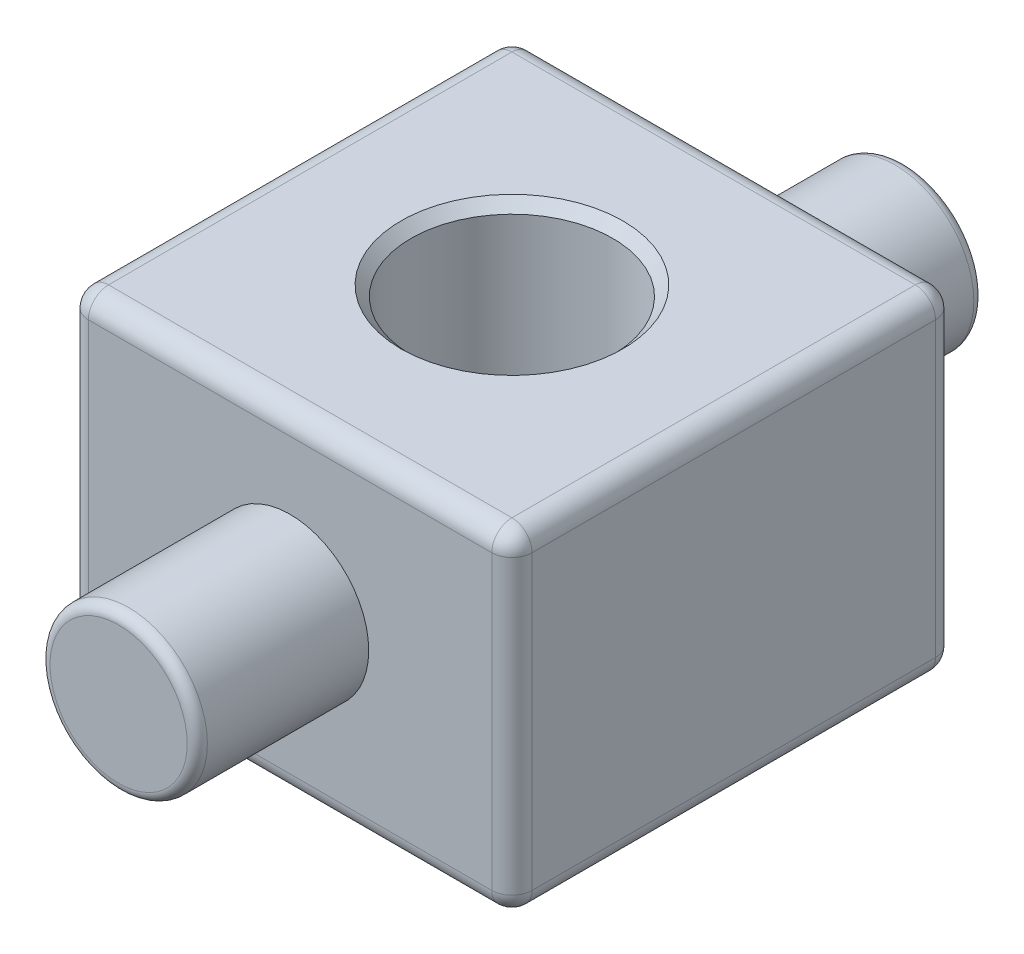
ISO-10303-21;
HEADER;
FILE_DESCRIPTION(('STEP AP214'),'2;1');
FILE_NAME('part.step','',(''),(''),'','','');
FILE_SCHEMA(('AUTOMOTIVE_DESIGN { 1 0 10303 214 1 1 1 1 }'));
ENDSEC;
DATA;
#1=APPLICATION_CONTEXT('core data for automotive mechanical design processes');
#2=APPLICATION_PROTOCOL_DEFINITION('international standard','automotive_design',2000,#1);
#3=PRODUCT_CONTEXT('',#1,'mechanical');
#4=PRODUCT('Part','Part','',(#3));
#5=PRODUCT_RELATED_PRODUCT_CATEGORY('part','',(#4));
#6=PRODUCT_DEFINITION_FORMATION('','',#4);
#7=PRODUCT_DEFINITION_CONTEXT('part definition',#1,'design');
#8=PRODUCT_DEFINITION('design','',#6,#7);
#9=PRODUCT_DEFINITION_SHAPE('','',#8);
#10=(LENGTH_UNIT() NAMED_UNIT(*) SI_UNIT(.MILLI.,.METRE.));
#11=(NAMED_UNIT(*) PLANE_ANGLE_UNIT() SI_UNIT($,.RADIAN.));
#12=(NAMED_UNIT(*) SI_UNIT($,.STERADIAN.) SOLID_ANGLE_UNIT());
#13=UNCERTAINTY_MEASURE_WITH_UNIT(LENGTH_MEASURE(1.E-05),#10,'distance_accuracy_value','');
#14=(GEOMETRIC_REPRESENTATION_CONTEXT(3) GLOBAL_UNCERTAINTY_ASSIGNED_CONTEXT((#13)) GLOBAL_UNIT_ASSIGNED_CONTEXT((#10,
#11,#12)) REPRESENTATION_CONTEXT('',''));
#15=CARTESIAN_POINT('',(0.,0.,0.));
#16=DIRECTION('',(0.,0.,1.));
#17=DIRECTION('',(1.,0.,0.));
#18=AXIS2_PLACEMENT_3D('',#15,#16,#17);
#19=CARTESIAN_POINT('',(11.,8.25,-11.));
#20=DIRECTION('',(1.,0.,0.));
#21=DIRECTION('',(0.,1.,0.));
#22=AXIS2_PLACEMENT_3D('',#19,#20,#21);
#23=PLANE('',#22);
#24=DIRECTION('',(0.,1.,0.));
#25=VECTOR('',#24,1.);
#26=CARTESIAN_POINT('',(11.,8.25,10.));
#27=LINE('',#26,#25);
#28=CARTESIAN_POINT('',(11.,7.25,10.));
#29=VERTEX_POINT('',#28);
#30=CARTESIAN_POINT('',(11.,-7.25,10.));
#31=VERTEX_POINT('',#30);
#32=EDGE_CURVE('E381',#29,#31,#27,.F.);
#33=ORIENTED_EDGE('',*,*,#32,.T.);
#34=DIRECTION('',(0.,0.,1.));
#35=VECTOR('',#34,1.);
#36=CARTESIAN_POINT('',(11.,-7.25,-11.));
#37=LINE('',#36,#35);
#38=CARTESIAN_POINT('',(11.,-7.25,-10.));
#39=VERTEX_POINT('',#38);
#40=EDGE_CURVE('E380',#31,#39,#37,.F.);
#41=ORIENTED_EDGE('',*,*,#40,.T.);
#42=DIRECTION('',(0.,1.,0.));
#43=VECTOR('',#42,1.);
#44=CARTESIAN_POINT('',(11.,8.25,-10.));
#45=LINE('',#44,#43);
#46=CARTESIAN_POINT('',(11.,7.25,-10.));
#47=VERTEX_POINT('',#46);
#48=EDGE_CURVE('E376',#39,#47,#45,.T.);
#49=ORIENTED_EDGE('',*,*,#48,.T.);
#50=DIRECTION('',(0.,0.,1.));
#51=VECTOR('',#50,1.);
#52=CARTESIAN_POINT('',(11.,7.25,-11.));
#53=LINE('',#52,#51);
#54=EDGE_CURVE('E408',#47,#29,#53,.T.);
#55=ORIENTED_EDGE('',*,*,#54,.T.);
#56=EDGE_LOOP('',(#33,#41,#49,#55));
#57=FACE_BOUND('',#56,.T.);
#58=ADVANCED_FACE('F33',(#57),#23,.T.);
#59=CARTESIAN_POINT('',(-11.,-8.25,-11.));
#60=DIRECTION('',(0.,-1.,0.));
#61=DIRECTION('',(0.,0.,-1.));
#62=AXIS2_PLACEMENT_3D('',#59,#60,#61);
#63=PLANE('',#62);
#64=CARTESIAN_POINT('',(0.,-8.25,0.));
#65=DIRECTION('',(0.,-1.,0.));
#66=DIRECTION('',(0.,0.,-1.));
#67=AXIS2_PLACEMENT_3D('',#64,#65,#66);
#68=CIRCLE('',#67,4.);
#69=CARTESIAN_POINT('',(0.,-8.25,-4.));
#70=VERTEX_POINT('',#69);
#71=EDGE_CURVE('E204',#70,#70,#68,.F.);
#72=ORIENTED_EDGE('',*,*,#71,.T.);
#73=EDGE_LOOP('',(#72));
#74=FACE_BOUND('',#73,.T.);
#75=DIRECTION('',(1.,0.,0.));
#76=VECTOR('',#75,1.);
#77=CARTESIAN_POINT('',(11.,-8.25,-10.));
#78=LINE('',#77,#76);
#79=CARTESIAN_POINT('',(-9.99999999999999,-8.25,-10.));
#80=VERTEX_POINT('',#79);
#81=CARTESIAN_POINT('',(10.,-8.25,-10.));
#82=VERTEX_POINT('',#81);
#83=EDGE_CURVE('E131',#80,#82,#78,.T.);
#84=ORIENTED_EDGE('',*,*,#83,.T.);
#85=DIRECTION('',(0.,0.,1.));
#86=VECTOR('',#85,1.);
#87=CARTESIAN_POINT('',(10.,-8.25,-11.));
#88=LINE('',#87,#86);
#89=CARTESIAN_POINT('',(10.,-8.25,10.));
#90=VERTEX_POINT('',#89);
#91=EDGE_CURVE('E127',#82,#90,#88,.T.);
#92=ORIENTED_EDGE('',*,*,#91,.T.);
#93=DIRECTION('',(1.,0.,0.));
#94=VECTOR('',#93,1.);
#95=CARTESIAN_POINT('',(-11.,-8.25,10.));
#96=LINE('',#95,#94);
#97=CARTESIAN_POINT('',(-9.99999999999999,-8.25,10.));
#98=VERTEX_POINT('',#97);
#99=EDGE_CURVE('E121',#90,#98,#96,.F.);
#100=ORIENTED_EDGE('',*,*,#99,.T.);
#101=DIRECTION('',(0.,0.,1.));
#102=VECTOR('',#101,1.);
#103=CARTESIAN_POINT('',(-9.99999999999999,-8.25,-11.));
#104=LINE('',#103,#102);
#105=EDGE_CURVE('E124',#98,#80,#104,.F.);
#106=ORIENTED_EDGE('',*,*,#105,.T.);
#107=EDGE_LOOP('',(#84,#92,#100,#106));
#108=FACE_BOUND('',#107,.T.);
#109=ADVANCED_FACE('F123',(#74,#108),#63,.T.);
#110=CARTESIAN_POINT('',(-11.,8.25,-11.));
#111=DIRECTION('',(-1.,0.,0.));
#112=DIRECTION('',(0.,-1.,0.));
#113=AXIS2_PLACEMENT_3D('',#110,#111,#112);
#114=PLANE('',#113);
#115=DIRECTION('',(0.,0.,1.));
#116=VECTOR('',#115,1.);
#117=CARTESIAN_POINT('',(-11.,7.25,-11.));
#118=LINE('',#117,#116);
#119=CARTESIAN_POINT('',(-11.,7.25,10.));
#120=VERTEX_POINT('',#119);
#121=CARTESIAN_POINT('',(-11.,7.25,-10.));
#122=VERTEX_POINT('',#121);
#123=EDGE_CURVE('E330',#120,#122,#118,.F.);
#124=ORIENTED_EDGE('',*,*,#123,.T.);
#125=DIRECTION('',(0.,-1.,0.));
#126=VECTOR('',#125,1.);
#127=CARTESIAN_POINT('',(-11.,-8.25,-10.));
#128=LINE('',#127,#126);
#129=CARTESIAN_POINT('',(-11.,-7.25,-10.));
#130=VERTEX_POINT('',#129);
#131=EDGE_CURVE('E338',#122,#130,#128,.T.);
#132=ORIENTED_EDGE('',*,*,#131,.T.);
#133=DIRECTION('',(0.,0.,1.));
#134=VECTOR('',#133,1.);
#135=CARTESIAN_POINT('',(-11.,-7.25,-11.));
#136=LINE('',#135,#134);
#137=CARTESIAN_POINT('',(-11.,-7.25,10.));
#138=VERTEX_POINT('',#137);
#139=EDGE_CURVE('E341',#130,#138,#136,.T.);
#140=ORIENTED_EDGE('',*,*,#139,.T.);
#141=DIRECTION('',(0.,-1.,0.));
#142=VECTOR('',#141,1.);
#143=CARTESIAN_POINT('',(-11.,8.25,10.));
#144=LINE('',#143,#142);
#145=EDGE_CURVE('E345',#138,#120,#144,.F.);
#146=ORIENTED_EDGE('',*,*,#145,.T.);
#147=EDGE_LOOP('',(#124,#132,#140,#146));
#148=FACE_BOUND('',#147,.T.);
#149=ADVANCED_FACE('F228',(#148),#114,.T.);
#150=CARTESIAN_POINT('',(-11.,8.25,-11.));
#151=DIRECTION('',(0.,1.,0.));
#152=DIRECTION('',(0.,0.,1.));
#153=AXIS2_PLACEMENT_3D('',#150,#151,#152);
#154=PLANE('',#153);
#155=CARTESIAN_POINT('',(0.,8.25,0.));
#156=DIRECTION('',(0.,1.,0.));
#157=DIRECTION('',(0.,0.,1.));
#158=AXIS2_PLACEMENT_3D('',#155,#156,#157);
#159=CIRCLE('',#158,5.5);
#160=CARTESIAN_POINT('',(0.,8.25,5.5));
#161=VERTEX_POINT('',#160);
#162=EDGE_CURVE('E11',#161,#161,#159,.F.);
#163=ORIENTED_EDGE('',*,*,#162,.T.);
#164=EDGE_LOOP('',(#163));
#165=FACE_BOUND('',#164,.T.);
#166=DIRECTION('',(0.,0.,1.));
#167=VECTOR('',#166,1.);
#168=CARTESIAN_POINT('',(10.,8.25,-11.));
#169=LINE('',#168,#167);
#170=CARTESIAN_POINT('',(10.,8.25,10.));
#171=VERTEX_POINT('',#170);
#172=CARTESIAN_POINT('',(10.,8.25,-10.));
#173=VERTEX_POINT('',#172);
#174=EDGE_CURVE('E48',#171,#173,#169,.F.);
#175=ORIENTED_EDGE('',*,*,#174,.T.);
#176=DIRECTION('',(-1.,0.,0.));
#177=VECTOR('',#176,1.);
#178=CARTESIAN_POINT('',(-11.,8.25,-10.));
#179=LINE('',#178,#177);
#180=CARTESIAN_POINT('',(-10.,8.25,-10.));
#181=VERTEX_POINT('',#180);
#182=EDGE_CURVE('E205',#173,#181,#179,.T.);
#183=ORIENTED_EDGE('',*,*,#182,.T.);
#184=DIRECTION('',(0.,0.,1.));
#185=VECTOR('',#184,1.);
#186=CARTESIAN_POINT('',(-10.,8.25,-11.));
#187=LINE('',#186,#185);
#188=CARTESIAN_POINT('',(-10.,8.25,10.));
#189=VERTEX_POINT('',#188);
#190=EDGE_CURVE('E331',#181,#189,#187,.T.);
#191=ORIENTED_EDGE('',*,*,#190,.T.);
#192=DIRECTION('',(-1.,0.,0.));
#193=VECTOR('',#192,1.);
#194=CARTESIAN_POINT('',(-11.,8.25,10.));
#195=LINE('',#194,#193);
#196=EDGE_CURVE('E53',#189,#171,#195,.F.);
#197=ORIENTED_EDGE('',*,*,#196,.T.);
#198=EDGE_LOOP('',(#175,#183,#191,#197));
#199=FACE_BOUND('',#198,.T.);
#200=ADVANCED_FACE('F233',(#165,#199),#154,.T.);
#201=CARTESIAN_POINT('',(0.,0.,-11.));
#202=DIRECTION('',(0.,0.,1.));
#203=DIRECTION('',(1.,0.,0.));
#204=AXIS2_PLACEMENT_3D('',#201,#202,#203);
#205=PLANE('',#204);
#206=DIRECTION('',(-1.,0.,0.));
#207=VECTOR('',#206,1.);
#208=CARTESIAN_POINT('',(11.,7.25,-11.));
#209=LINE('',#208,#207);
#210=CARTESIAN_POINT('',(-10.,7.25,-11.));
#211=VERTEX_POINT('',#210);
#212=CARTESIAN_POINT('',(10.,7.25,-11.));
#213=VERTEX_POINT('',#212);
#214=EDGE_CURVE('E387',#211,#213,#209,.F.);
#215=ORIENTED_EDGE('',*,*,#214,.T.);
#216=DIRECTION('',(0.,1.,0.));
#217=VECTOR('',#216,1.);
#218=CARTESIAN_POINT('',(10.,-8.25,-11.));
#219=LINE('',#218,#217);
#220=CARTESIAN_POINT('',(10.,-7.25,-11.));
#221=VERTEX_POINT('',#220);
#222=EDGE_CURVE('E396',#213,#221,#219,.F.);
#223=ORIENTED_EDGE('',*,*,#222,.T.);
#224=DIRECTION('',(1.,0.,0.));
#225=VECTOR('',#224,1.);
#226=CARTESIAN_POINT('',(-11.,-7.25,-11.));
#227=LINE('',#226,#225);
#228=CARTESIAN_POINT('',(-9.99999999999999,-7.25,-11.));
#229=VERTEX_POINT('',#228);
#230=EDGE_CURVE('E394',#221,#229,#227,.F.);
#231=ORIENTED_EDGE('',*,*,#230,.T.);
#232=DIRECTION('',(0.,-1.,0.));
#233=VECTOR('',#232,1.);
#234=CARTESIAN_POINT('',(-10.,8.25,-11.));
#235=LINE('',#234,#233);
#236=EDGE_CURVE('E389',#229,#211,#235,.F.);
#237=ORIENTED_EDGE('',*,*,#236,.T.);
#238=EDGE_LOOP('',(#215,#223,#231,#237));
#239=FACE_BOUND('',#238,.T.);
#240=CARTESIAN_POINT('',(0.,0.,-11.));
#241=DIRECTION('',(0.,0.,1.));
#242=DIRECTION('',(1.,0.,0.));
#243=AXIS2_PLACEMENT_3D('',#240,#241,#242);
#244=CIRCLE('',#243,3.9);
#245=CARTESIAN_POINT('',(3.9,0.,-11.));
#246=VERTEX_POINT('',#245);
#247=EDGE_CURVE('E451',#246,#246,#244,.T.);
#248=ORIENTED_EDGE('',*,*,#247,.T.);
#249=EDGE_LOOP('',(#248));
#250=FACE_BOUND('',#249,.T.);
#251=ADVANCED_FACE('F411',(#239,#250),#205,.F.);
#252=CARTESIAN_POINT('',(0.,0.,11.));
#253=DIRECTION('',(0.,0.,1.));
#254=DIRECTION('',(1.,0.,0.));
#255=AXIS2_PLACEMENT_3D('',#252,#253,#254);
#256=PLANE('',#255);
#257=DIRECTION('',(1.,0.,0.));
#258=VECTOR('',#257,1.);
#259=CARTESIAN_POINT('',(0.,-7.25,11.));
#260=LINE('',#259,#258);
#261=CARTESIAN_POINT('',(-9.99999999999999,-7.25,11.));
#262=VERTEX_POINT('',#261);
#263=CARTESIAN_POINT('',(10.,-7.25,11.));
#264=VERTEX_POINT('',#263);
#265=EDGE_CURVE('E153',#262,#264,#260,.T.);
#266=ORIENTED_EDGE('',*,*,#265,.T.);
#267=DIRECTION('',(0.,1.,0.));
#268=VECTOR('',#267,1.);
#269=CARTESIAN_POINT('',(10.,0.,11.));
#270=LINE('',#269,#268);
#271=CARTESIAN_POINT('',(10.,7.25,11.));
#272=VERTEX_POINT('',#271);
#273=EDGE_CURVE('E351',#264,#272,#270,.T.);
#274=ORIENTED_EDGE('',*,*,#273,.T.);
#275=DIRECTION('',(-1.,0.,0.));
#276=VECTOR('',#275,1.);
#277=CARTESIAN_POINT('',(0.,7.25,11.));
#278=LINE('',#277,#276);
#279=CARTESIAN_POINT('',(-10.,7.25,11.));
#280=VERTEX_POINT('',#279);
#281=EDGE_CURVE('E340',#272,#280,#278,.T.);
#282=ORIENTED_EDGE('',*,*,#281,.T.);
#283=DIRECTION('',(0.,-1.,0.));
#284=VECTOR('',#283,1.);
#285=CARTESIAN_POINT('',(-10.,0.,11.));
#286=LINE('',#285,#284);
#287=EDGE_CURVE('E343',#280,#262,#286,.T.);
#288=ORIENTED_EDGE('',*,*,#287,.T.);
#289=EDGE_LOOP('',(#266,#274,#282,#288));
#290=FACE_BOUND('',#289,.T.);
#291=CARTESIAN_POINT('',(0.,0.,11.));
#292=DIRECTION('',(0.,0.,1.));
#293=DIRECTION('',(1.,0.,0.));
#294=AXIS2_PLACEMENT_3D('',#291,#292,#293);
#295=CIRCLE('',#294,3.9);
#296=CARTESIAN_POINT('',(3.9,0.,11.));
#297=VERTEX_POINT('',#296);
#298=EDGE_CURVE('E454',#297,#297,#295,.T.);
#299=ORIENTED_EDGE('',*,*,#298,.F.);
#300=EDGE_LOOP('',(#299));
#301=FACE_BOUND('',#300,.T.);
#302=ADVANCED_FACE('F417',(#290,#301),#256,.T.);
#303=CARTESIAN_POINT('',(0.,0.,19.5));
#304=DIRECTION('',(0.,0.,-1.));
#305=DIRECTION('',(-1.,0.,0.));
#306=AXIS2_PLACEMENT_3D('',#303,#304,#305);
#307=CYLINDRICAL_SURFACE('',#306,3.9);
#308=CARTESIAN_POINT('',(0.,0.,19.));
#309=DIRECTION('',(0.,0.,1.));
#310=DIRECTION('',(1.,0.,0.));
#311=AXIS2_PLACEMENT_3D('',#308,#309,#310);
#312=CIRCLE('',#311,3.9);
#313=CARTESIAN_POINT('',(3.9,0.,19.));
#314=VERTEX_POINT('',#313);
#315=EDGE_CURVE('E463',#314,#314,#312,.F.);
#316=ORIENTED_EDGE('',*,*,#315,.T.);
#317=EDGE_LOOP('',(#316));
#318=FACE_BOUND('',#317,.T.);
#319=ORIENTED_EDGE('',*,*,#298,.T.);
#320=EDGE_LOOP('',(#319));
#321=FACE_BOUND('',#320,.T.);
#322=ADVANCED_FACE('F425',(#318,#321),#307,.T.);
#323=CARTESIAN_POINT('',(0.,0.,19.5));
#324=DIRECTION('',(0.,0.,1.));
#325=DIRECTION('',(1.,0.,0.));
#326=AXIS2_PLACEMENT_3D('',#323,#324,#325);
#327=PLANE('',#326);
#328=CARTESIAN_POINT('',(0.,0.,19.5));
#329=DIRECTION('',(0.,0.,1.));
#330=DIRECTION('',(1.,0.,0.));
#331=AXIS2_PLACEMENT_3D('',#328,#329,#330);
#332=CIRCLE('',#331,3.4);
#333=CARTESIAN_POINT('',(3.4,0.,19.5));
#334=VERTEX_POINT('',#333);
#335=EDGE_CURVE('E460',#334,#334,#332,.T.);
#336=ORIENTED_EDGE('',*,*,#335,.T.);
#337=EDGE_LOOP('',(#336));
#338=FACE_BOUND('',#337,.T.);
#339=ADVANCED_FACE('F239',(#338),#327,.T.);
#340=CARTESIAN_POINT('',(0.,0.,19.));
#341=DIRECTION('',(0.,0.,1.));
#342=DIRECTION('',(1.,0.,0.));
#343=AXIS2_PLACEMENT_3D('',#340,#341,#342);
#344=TOROIDAL_SURFACE('',#343,3.4,0.5);
#345=ORIENTED_EDGE('',*,*,#315,.F.);
#346=EDGE_LOOP('',(#345));
#347=FACE_BOUND('',#346,.T.);
#348=ORIENTED_EDGE('',*,*,#335,.F.);
#349=EDGE_LOOP('',(#348));
#350=FACE_BOUND('',#349,.T.);
#351=ADVANCED_FACE('F235',(#347,#350),#344,.T.);
#352=CARTESIAN_POINT('',(0.,0.,-19.5));
#353=DIRECTION('',(0.,0.,1.));
#354=DIRECTION('',(1.,0.,0.));
#355=AXIS2_PLACEMENT_3D('',#352,#353,#354);
#356=CYLINDRICAL_SURFACE('',#355,3.9);
#357=CARTESIAN_POINT('',(0.,0.,-19.));
#358=DIRECTION('',(0.,0.,-1.));
#359=DIRECTION('',(-1.,0.,0.));
#360=AXIS2_PLACEMENT_3D('',#357,#358,#359);
#361=CIRCLE('',#360,3.9);
#362=CARTESIAN_POINT('',(-3.9,0.,-19.));
#363=VERTEX_POINT('',#362);
#364=EDGE_CURVE('E466',#363,#363,#361,.F.);
#365=ORIENTED_EDGE('',*,*,#364,.T.);
#366=EDGE_LOOP('',(#365));
#367=FACE_BOUND('',#366,.T.);
#368=ORIENTED_EDGE('',*,*,#247,.F.);
#369=EDGE_LOOP('',(#368));
#370=FACE_BOUND('',#369,.T.);
#371=ADVANCED_FACE('F238',(#367,#370),#356,.T.);
#372=CARTESIAN_POINT('',(0.,0.,-19.5));
#373=DIRECTION('',(0.,0.,-1.));
#374=DIRECTION('',(1.,0.,0.));
#375=AXIS2_PLACEMENT_3D('',#372,#373,#374);
#376=PLANE('',#375);
#377=CARTESIAN_POINT('',(0.,0.,-19.5));
#378=DIRECTION('',(0.,0.,-1.));
#379=DIRECTION('',(-1.,0.,0.));
#380=AXIS2_PLACEMENT_3D('',#377,#378,#379);
#381=CIRCLE('',#380,3.4);
#382=CARTESIAN_POINT('',(-3.4,0.,-19.5));
#383=VERTEX_POINT('',#382);
#384=EDGE_CURVE('E142',#383,#383,#381,.T.);
#385=ORIENTED_EDGE('',*,*,#384,.T.);
#386=EDGE_LOOP('',(#385));
#387=FACE_BOUND('',#386,.T.);
#388=ADVANCED_FACE('F244',(#387),#376,.T.);
#389=CARTESIAN_POINT('',(0.,0.,-19.));
#390=DIRECTION('',(0.,0.,-1.));
#391=DIRECTION('',(-1.,0.,0.));
#392=AXIS2_PLACEMENT_3D('',#389,#390,#391);
#393=TOROIDAL_SURFACE('',#392,3.4,0.5);
#394=ORIENTED_EDGE('',*,*,#384,.F.);
#395=EDGE_LOOP('',(#394));
#396=FACE_BOUND('',#395,.T.);
#397=ORIENTED_EDGE('',*,*,#364,.F.);
#398=EDGE_LOOP('',(#397));
#399=FACE_BOUND('',#398,.T.);
#400=ADVANCED_FACE('F241',(#396,#399),#393,.T.);
#401=CARTESIAN_POINT('',(0.,-3.75,0.));
#402=DIRECTION('',(0.,1.,0.));
#403=DIRECTION('',(0.,0.,1.));
#404=AXIS2_PLACEMENT_3D('',#401,#402,#403);
#405=CYLINDRICAL_SURFACE('',#404,5.);
#406=CARTESIAN_POINT('',(0.,7.75,0.));
#407=DIRECTION('',(0.,1.,0.));
#408=DIRECTION('',(0.,0.,1.));
#409=AXIS2_PLACEMENT_3D('',#406,#407,#408);
#410=CIRCLE('',#409,5.);
#411=CARTESIAN_POINT('',(0.,7.75,5.));
#412=VERTEX_POINT('',#411);
#413=EDGE_CURVE('E41',#412,#412,#410,.T.);
#414=ORIENTED_EDGE('',*,*,#413,.T.);
#415=EDGE_LOOP('',(#414));
#416=FACE_BOUND('',#415,.T.);
#417=CARTESIAN_POINT('',(0.,-3.75,0.));
#418=DIRECTION('',(0.,1.,0.));
#419=DIRECTION('',(0.,0.,1.));
#420=AXIS2_PLACEMENT_3D('',#417,#418,#419);
#421=CIRCLE('',#420,5.);
#422=CARTESIAN_POINT('',(0.,-3.75,5.));
#423=VERTEX_POINT('',#422);
#424=EDGE_CURVE('E450',#423,#423,#421,.T.);
#425=ORIENTED_EDGE('',*,*,#424,.F.);
#426=EDGE_LOOP('',(#425));
#427=FACE_BOUND('',#426,.T.);
#428=ADVANCED_FACE('F210',(#416,#427),#405,.F.);
#429=CARTESIAN_POINT('',(0.,-3.75,0.));
#430=DIRECTION('',(0.,1.,0.));
#431=DIRECTION('',(0.,0.,1.));
#432=AXIS2_PLACEMENT_3D('',#429,#430,#431);
#433=PLANE('',#432);
#434=CARTESIAN_POINT('',(0.,-3.75,0.));
#435=DIRECTION('',(0.,1.,0.));
#436=DIRECTION('',(0.,0.,1.));
#437=AXIS2_PLACEMENT_3D('',#434,#435,#436);
#438=CIRCLE('',#437,3.5);
#439=CARTESIAN_POINT('',(0.,-3.75,3.5));
#440=VERTEX_POINT('',#439);
#441=EDGE_CURVE('E200',#440,#440,#438,.F.);
#442=ORIENTED_EDGE('',*,*,#441,.T.);
#443=EDGE_LOOP('',(#442));
#444=FACE_BOUND('',#443,.T.);
#445=ORIENTED_EDGE('',*,*,#424,.T.);
#446=EDGE_LOOP('',(#445));
#447=FACE_BOUND('',#446,.T.);
#448=ADVANCED_FACE('F322',(#444,#447),#433,.T.);
#449=CARTESIAN_POINT('',(0.,8.251,0.));
#450=DIRECTION('',(0.,-1.,0.));
#451=DIRECTION('',(0.,0.,-1.));
#452=AXIS2_PLACEMENT_3D('',#449,#450,#451);
#453=CYLINDRICAL_SURFACE('',#452,3.5);
#454=CARTESIAN_POINT('',(0.,-7.74999999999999,0.));
#455=DIRECTION('',(0.,-1.,0.));
#456=DIRECTION('',(0.,0.,-1.));
#457=AXIS2_PLACEMENT_3D('',#454,#455,#456);
#458=CIRCLE('',#457,3.5);
#459=CARTESIAN_POINT('',(0.,-7.74999999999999,-3.5));
#460=VERTEX_POINT('',#459);
#461=EDGE_CURVE('E201',#460,#460,#458,.T.);
#462=ORIENTED_EDGE('',*,*,#461,.T.);
#463=EDGE_LOOP('',(#462));
#464=FACE_BOUND('',#463,.T.);
#465=ORIENTED_EDGE('',*,*,#441,.F.);
#466=EDGE_LOOP('',(#465));
#467=FACE_BOUND('',#466,.T.);
#468=ADVANCED_FACE('F317',(#464,#467),#453,.F.);
#469=CARTESIAN_POINT('',(-10.,7.25,-11.));
#470=DIRECTION('',(0.,0.,1.));
#471=DIRECTION('',(1.,0.,0.));
#472=AXIS2_PLACEMENT_3D('',#469,#470,#471);
#473=CYLINDRICAL_SURFACE('',#472,1.);
#474=CARTESIAN_POINT('',(-10.,7.25,-10.));
#475=DIRECTION('',(0.,0.,-1.));
#476=DIRECTION('',(-1.,0.,0.));
#477=AXIS2_PLACEMENT_3D('',#474,#475,#476);
#478=CIRCLE('',#477,1.);
#479=EDGE_CURVE('E197',#122,#181,#478,.T.);
#480=ORIENTED_EDGE('',*,*,#479,.F.);
#481=ORIENTED_EDGE('',*,*,#123,.F.);
#482=CARTESIAN_POINT('',(-10.,7.25,10.));
#483=DIRECTION('',(0.,0.,1.));
#484=DIRECTION('',(1.,0.,0.));
#485=AXIS2_PLACEMENT_3D('',#482,#483,#484);
#486=CIRCLE('',#485,1.);
#487=EDGE_CURVE('E194',#189,#120,#486,.T.);
#488=ORIENTED_EDGE('',*,*,#487,.F.);
#489=ORIENTED_EDGE('',*,*,#190,.F.);
#490=EDGE_LOOP('',(#480,#481,#488,#489));
#491=FACE_BOUND('',#490,.T.);
#492=ADVANCED_FACE('F314',(#491),#473,.T.);
#493=CARTESIAN_POINT('',(-10.,7.25,-10.));
#494=DIRECTION('',(0.,0.,1.));
#495=DIRECTION('',(1.,0.,0.));
#496=AXIS2_PLACEMENT_3D('',#493,#494,#495);
#497=SPHERICAL_SURFACE('',#496,1.);
#498=CARTESIAN_POINT('',(-10.,7.25,-10.));
#499=DIRECTION('',(0.,1.,0.));
#500=DIRECTION('',(0.,0.,1.));
#501=AXIS2_PLACEMENT_3D('',#498,#499,#500);
#502=CIRCLE('',#501,1.);
#503=EDGE_CURVE('E189',#122,#211,#502,.F.);
#504=ORIENTED_EDGE('',*,*,#503,.F.);
#505=ORIENTED_EDGE('',*,*,#479,.T.);
#506=CARTESIAN_POINT('',(-10.,7.25,-10.));
#507=DIRECTION('',(-1.,0.,0.));
#508=DIRECTION('',(0.,0.,1.));
#509=AXIS2_PLACEMENT_3D('',#506,#507,#508);
#510=CIRCLE('',#509,1.);
#511=EDGE_CURVE('E192',#211,#181,#510,.F.);
#512=ORIENTED_EDGE('',*,*,#511,.F.);
#513=EDGE_LOOP('',(#504,#505,#512));
#514=FACE_BOUND('',#513,.T.);
#515=ADVANCED_FACE('F310',(#514),#497,.T.);
#516=CARTESIAN_POINT('',(-10.,7.25,10.));
#517=DIRECTION('',(0.,0.,1.));
#518=DIRECTION('',(1.,0.,0.));
#519=AXIS2_PLACEMENT_3D('',#516,#517,#518);
#520=SPHERICAL_SURFACE('',#519,1.);
#521=CARTESIAN_POINT('',(-10.,7.25,10.));
#522=DIRECTION('',(-1.,0.,0.));
#523=DIRECTION('',(0.,0.,1.));
#524=AXIS2_PLACEMENT_3D('',#521,#522,#523);
#525=CIRCLE('',#524,1.);
#526=EDGE_CURVE('E183',#189,#280,#525,.F.);
#527=ORIENTED_EDGE('',*,*,#526,.F.);
#528=ORIENTED_EDGE('',*,*,#487,.T.);
#529=CARTESIAN_POINT('',(-10.,7.25,10.));
#530=DIRECTION('',(0.,1.,0.));
#531=DIRECTION('',(0.,0.,1.));
#532=AXIS2_PLACEMENT_3D('',#529,#530,#531);
#533=CIRCLE('',#532,1.);
#534=EDGE_CURVE('E186',#280,#120,#533,.F.);
#535=ORIENTED_EDGE('',*,*,#534,.F.);
#536=EDGE_LOOP('',(#527,#528,#535));
#537=FACE_BOUND('',#536,.T.);
#538=ADVANCED_FACE('F306',(#537),#520,.T.);
#539=CARTESIAN_POINT('',(-11.,7.25,-10.));
#540=DIRECTION('',(1.,0.,0.));
#541=DIRECTION('',(0.,0.,-1.));
#542=AXIS2_PLACEMENT_3D('',#539,#540,#541);
#543=CYLINDRICAL_SURFACE('',#542,1.);
#544=ORIENTED_EDGE('',*,*,#511,.T.);
#545=ORIENTED_EDGE('',*,*,#182,.F.);
#546=CARTESIAN_POINT('',(10.,7.25,-10.));
#547=DIRECTION('',(1.,0.,0.));
#548=DIRECTION('',(0.,0.,-1.));
#549=AXIS2_PLACEMENT_3D('',#546,#547,#548);
#550=CIRCLE('',#549,1.);
#551=EDGE_CURVE('E177',#213,#173,#550,.T.);
#552=ORIENTED_EDGE('',*,*,#551,.F.);
#553=ORIENTED_EDGE('',*,*,#214,.F.);
#554=EDGE_LOOP('',(#544,#545,#552,#553));
#555=FACE_BOUND('',#554,.T.);
#556=ADVANCED_FACE('F302',(#555),#543,.T.);
#557=CARTESIAN_POINT('',(-10.,8.25,-10.));
#558=DIRECTION('',(0.,1.,0.));
#559=DIRECTION('',(-1.,0.,0.));
#560=AXIS2_PLACEMENT_3D('',#557,#558,#559);
#561=CYLINDRICAL_SURFACE('',#560,1.);
#562=ORIENTED_EDGE('',*,*,#503,.T.);
#563=ORIENTED_EDGE('',*,*,#236,.F.);
#564=CARTESIAN_POINT('',(-9.99999999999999,-7.25,-10.));
#565=DIRECTION('',(0.,-1.,0.));
#566=DIRECTION('',(0.,0.,-1.));
#567=AXIS2_PLACEMENT_3D('',#564,#565,#566);
#568=CIRCLE('',#567,1.);
#569=EDGE_CURVE('E174',#130,#229,#568,.T.);
#570=ORIENTED_EDGE('',*,*,#569,.F.);
#571=ORIENTED_EDGE('',*,*,#131,.F.);
#572=EDGE_LOOP('',(#562,#563,#570,#571));
#573=FACE_BOUND('',#572,.T.);
#574=ADVANCED_FACE('F299',(#573),#561,.T.);
#575=CARTESIAN_POINT('',(-9.99999999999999,-7.25,-11.));
#576=DIRECTION('',(0.,0.,1.));
#577=DIRECTION('',(1.,0.,0.));
#578=AXIS2_PLACEMENT_3D('',#575,#576,#577);
#579=CYLINDRICAL_SURFACE('',#578,1.);
#580=CARTESIAN_POINT('',(-9.99999999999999,-7.25,10.));
#581=DIRECTION('',(0.,0.,1.));
#582=DIRECTION('',(1.,0.,0.));
#583=AXIS2_PLACEMENT_3D('',#580,#581,#582);
#584=CIRCLE('',#583,1.);
#585=EDGE_CURVE('E138',#138,#98,#584,.T.);
#586=ORIENTED_EDGE('',*,*,#585,.F.);
#587=ORIENTED_EDGE('',*,*,#139,.F.);
#588=CARTESIAN_POINT('',(-9.99999999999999,-7.25,-10.));
#589=DIRECTION('',(0.,0.,-1.));
#590=DIRECTION('',(-1.,0.,0.));
#591=AXIS2_PLACEMENT_3D('',#588,#589,#590);
#592=CIRCLE('',#591,1.);
#593=EDGE_CURVE('E140',#80,#130,#592,.T.);
#594=ORIENTED_EDGE('',*,*,#593,.F.);
#595=ORIENTED_EDGE('',*,*,#105,.F.);
#596=EDGE_LOOP('',(#586,#587,#594,#595));
#597=FACE_BOUND('',#596,.T.);
#598=ADVANCED_FACE('F136',(#597),#579,.T.);
#599=CARTESIAN_POINT('',(-10.,0.,10.));
#600=DIRECTION('',(0.,-1.,0.));
#601=DIRECTION('',(1.,0.,0.));
#602=AXIS2_PLACEMENT_3D('',#599,#600,#601);
#603=CYLINDRICAL_SURFACE('',#602,1.);
#604=ORIENTED_EDGE('',*,*,#534,.T.);
#605=ORIENTED_EDGE('',*,*,#145,.F.);
#606=CARTESIAN_POINT('',(-9.99999999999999,-7.25,10.));
#607=DIRECTION('',(0.,-1.,0.));
#608=DIRECTION('',(1.,0.,0.));
#609=AXIS2_PLACEMENT_3D('',#606,#607,#608);
#610=CIRCLE('',#609,1.);
#611=EDGE_CURVE('E150',#262,#138,#610,.T.);
#612=ORIENTED_EDGE('',*,*,#611,.F.);
#613=ORIENTED_EDGE('',*,*,#287,.F.);
#614=EDGE_LOOP('',(#604,#605,#612,#613));
#615=FACE_BOUND('',#614,.T.);
#616=ADVANCED_FACE('F292',(#615),#603,.T.);
#617=CARTESIAN_POINT('',(0.,7.25,10.));
#618=DIRECTION('',(-1.,0.,0.));
#619=DIRECTION('',(0.,0.,1.));
#620=AXIS2_PLACEMENT_3D('',#617,#618,#619);
#621=CYLINDRICAL_SURFACE('',#620,1.);
#622=ORIENTED_EDGE('',*,*,#526,.T.);
#623=ORIENTED_EDGE('',*,*,#281,.F.);
#624=CARTESIAN_POINT('',(10.,7.25,10.));
#625=DIRECTION('',(1.,0.,0.));
#626=DIRECTION('',(0.,0.,-1.));
#627=AXIS2_PLACEMENT_3D('',#624,#625,#626);
#628=CIRCLE('',#627,1.);
#629=EDGE_CURVE('E169',#171,#272,#628,.T.);
#630=ORIENTED_EDGE('',*,*,#629,.F.);
#631=ORIENTED_EDGE('',*,*,#196,.F.);
#632=EDGE_LOOP('',(#622,#623,#630,#631));
#633=FACE_BOUND('',#632,.T.);
#634=ADVANCED_FACE('F288',(#633),#621,.T.);
#635=CARTESIAN_POINT('',(10.,7.25,-11.));
#636=DIRECTION('',(0.,0.,1.));
#637=DIRECTION('',(1.,0.,0.));
#638=AXIS2_PLACEMENT_3D('',#635,#636,#637);
#639=CYLINDRICAL_SURFACE('',#638,1.);
#640=CARTESIAN_POINT('',(10.,7.25,-10.));
#641=DIRECTION('',(0.,0.,-1.));
#642=DIRECTION('',(-1.,0.,0.));
#643=AXIS2_PLACEMENT_3D('',#640,#641,#642);
#644=CIRCLE('',#643,1.);
#645=EDGE_CURVE('E180',#173,#47,#644,.T.);
#646=ORIENTED_EDGE('',*,*,#645,.F.);
#647=ORIENTED_EDGE('',*,*,#174,.F.);
#648=CARTESIAN_POINT('',(10.,7.25,10.));
#649=DIRECTION('',(0.,0.,1.));
#650=DIRECTION('',(1.,0.,0.));
#651=AXIS2_PLACEMENT_3D('',#648,#649,#650);
#652=CIRCLE('',#651,1.);
#653=EDGE_CURVE('E166',#29,#171,#652,.T.);
#654=ORIENTED_EDGE('',*,*,#653,.F.);
#655=ORIENTED_EDGE('',*,*,#54,.F.);
#656=EDGE_LOOP('',(#646,#647,#654,#655));
#657=FACE_BOUND('',#656,.T.);
#658=ADVANCED_FACE('F284',(#657),#639,.T.);
#659=CARTESIAN_POINT('',(10.,7.25,-10.));
#660=DIRECTION('',(0.,0.,1.));
#661=DIRECTION('',(1.,0.,0.));
#662=AXIS2_PLACEMENT_3D('',#659,#660,#661);
#663=SPHERICAL_SURFACE('',#662,1.);
#664=ORIENTED_EDGE('',*,*,#551,.T.);
#665=ORIENTED_EDGE('',*,*,#645,.T.);
#666=CARTESIAN_POINT('',(10.,7.25,-10.));
#667=DIRECTION('',(0.,1.,0.));
#668=DIRECTION('',(0.,0.,1.));
#669=AXIS2_PLACEMENT_3D('',#666,#667,#668);
#670=CIRCLE('',#669,1.);
#671=EDGE_CURVE('E158',#213,#47,#670,.F.);
#672=ORIENTED_EDGE('',*,*,#671,.F.);
#673=EDGE_LOOP('',(#664,#665,#672));
#674=FACE_BOUND('',#673,.T.);
#675=ADVANCED_FACE('F280',(#674),#663,.T.);
#676=CARTESIAN_POINT('',(-9.99999999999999,-7.25,-10.));
#677=DIRECTION('',(0.,0.,1.));
#678=DIRECTION('',(1.,0.,0.));
#679=AXIS2_PLACEMENT_3D('',#676,#677,#678);
#680=SPHERICAL_SURFACE('',#679,1.);
#681=ORIENTED_EDGE('',*,*,#593,.T.);
#682=ORIENTED_EDGE('',*,*,#569,.T.);
#683=CARTESIAN_POINT('',(-9.99999999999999,-7.25,-10.));
#684=DIRECTION('',(-1.,0.,0.));
#685=DIRECTION('',(0.,0.,1.));
#686=AXIS2_PLACEMENT_3D('',#683,#684,#685);
#687=CIRCLE('',#686,1.);
#688=EDGE_CURVE('E154',#80,#229,#687,.F.);
#689=ORIENTED_EDGE('',*,*,#688,.F.);
#690=EDGE_LOOP('',(#681,#682,#689));
#691=FACE_BOUND('',#690,.T.);
#692=ADVANCED_FACE('F277',(#691),#680,.T.);
#693=CARTESIAN_POINT('',(-9.99999999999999,-7.25,10.));
#694=DIRECTION('',(0.,0.,1.));
#695=DIRECTION('',(1.,0.,0.));
#696=AXIS2_PLACEMENT_3D('',#693,#694,#695);
#697=SPHERICAL_SURFACE('',#696,1.);
#698=ORIENTED_EDGE('',*,*,#611,.T.);
#699=ORIENTED_EDGE('',*,*,#585,.T.);
#700=CARTESIAN_POINT('',(-9.99999999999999,-7.25,10.));
#701=DIRECTION('',(-1.,0.,0.));
#702=DIRECTION('',(0.,0.,1.));
#703=AXIS2_PLACEMENT_3D('',#700,#701,#702);
#704=CIRCLE('',#703,1.);
#705=EDGE_CURVE('E147',#262,#98,#704,.F.);
#706=ORIENTED_EDGE('',*,*,#705,.F.);
#707=EDGE_LOOP('',(#698,#699,#706));
#708=FACE_BOUND('',#707,.T.);
#709=ADVANCED_FACE('F146',(#708),#697,.T.);
#710=CARTESIAN_POINT('',(10.,7.25,10.));
#711=DIRECTION('',(0.,0.,1.));
#712=DIRECTION('',(1.,0.,0.));
#713=AXIS2_PLACEMENT_3D('',#710,#711,#712);
#714=SPHERICAL_SURFACE('',#713,1.);
#715=ORIENTED_EDGE('',*,*,#653,.T.);
#716=ORIENTED_EDGE('',*,*,#629,.T.);
#717=CARTESIAN_POINT('',(10.,7.25,10.));
#718=DIRECTION('',(0.,1.,0.));
#719=DIRECTION('',(0.,0.,1.));
#720=AXIS2_PLACEMENT_3D('',#717,#718,#719);
#721=CIRCLE('',#720,1.);
#722=EDGE_CURVE('E155',#29,#272,#721,.F.);
#723=ORIENTED_EDGE('',*,*,#722,.F.);
#724=EDGE_LOOP('',(#715,#716,#723));
#725=FACE_BOUND('',#724,.T.);
#726=ADVANCED_FACE('F270',(#725),#714,.T.);
#727=CARTESIAN_POINT('',(10.,8.25,-10.));
#728=DIRECTION('',(0.,-1.,0.));
#729=DIRECTION('',(1.,0.,0.));
#730=AXIS2_PLACEMENT_3D('',#727,#728,#729);
#731=CYLINDRICAL_SURFACE('',#730,1.);
#732=ORIENTED_EDGE('',*,*,#671,.T.);
#733=ORIENTED_EDGE('',*,*,#48,.F.);
#734=CARTESIAN_POINT('',(10.,-7.25,-10.));
#735=DIRECTION('',(0.,-1.,0.));
#736=DIRECTION('',(0.,0.,-1.));
#737=AXIS2_PLACEMENT_3D('',#734,#735,#736);
#738=CIRCLE('',#737,1.);
#739=EDGE_CURVE('E160',#221,#39,#738,.T.);
#740=ORIENTED_EDGE('',*,*,#739,.F.);
#741=ORIENTED_EDGE('',*,*,#222,.F.);
#742=EDGE_LOOP('',(#732,#733,#740,#741));
#743=FACE_BOUND('',#742,.T.);
#744=ADVANCED_FACE('F266',(#743),#731,.T.);
#745=CARTESIAN_POINT('',(-11.,-7.25,-10.));
#746=DIRECTION('',(-1.,0.,0.));
#747=DIRECTION('',(0.,0.,1.));
#748=AXIS2_PLACEMENT_3D('',#745,#746,#747);
#749=CYLINDRICAL_SURFACE('',#748,1.);
#750=ORIENTED_EDGE('',*,*,#688,.T.);
#751=ORIENTED_EDGE('',*,*,#230,.F.);
#752=CARTESIAN_POINT('',(10.,-7.25,-10.));
#753=DIRECTION('',(1.,0.,0.));
#754=DIRECTION('',(0.,0.,-1.));
#755=AXIS2_PLACEMENT_3D('',#752,#753,#754);
#756=CIRCLE('',#755,1.);
#757=EDGE_CURVE('E368',#82,#221,#756,.T.);
#758=ORIENTED_EDGE('',*,*,#757,.F.);
#759=ORIENTED_EDGE('',*,*,#83,.F.);
#760=EDGE_LOOP('',(#750,#751,#758,#759));
#761=FACE_BOUND('',#760,.T.);
#762=ADVANCED_FACE('F263',(#761),#749,.T.);
#763=CARTESIAN_POINT('',(0.,-7.25,10.));
#764=DIRECTION('',(1.,0.,0.));
#765=DIRECTION('',(0.,0.,-1.));
#766=AXIS2_PLACEMENT_3D('',#763,#764,#765);
#767=CYLINDRICAL_SURFACE('',#766,1.);
#768=ORIENTED_EDGE('',*,*,#705,.T.);
#769=ORIENTED_EDGE('',*,*,#99,.F.);
#770=CARTESIAN_POINT('',(10.,-7.25,10.));
#771=DIRECTION('',(1.,0.,0.));
#772=DIRECTION('',(0.,1.,0.));
#773=AXIS2_PLACEMENT_3D('',#770,#771,#772);
#774=CIRCLE('',#773,1.);
#775=EDGE_CURVE('E365',#264,#90,#774,.T.);
#776=ORIENTED_EDGE('',*,*,#775,.F.);
#777=ORIENTED_EDGE('',*,*,#265,.F.);
#778=EDGE_LOOP('',(#768,#769,#776,#777));
#779=FACE_BOUND('',#778,.T.);
#780=ADVANCED_FACE('F152',(#779),#767,.T.);
#781=CARTESIAN_POINT('',(10.,0.,10.));
#782=DIRECTION('',(0.,1.,0.));
#783=DIRECTION('',(-1.,0.,0.));
#784=AXIS2_PLACEMENT_3D('',#781,#782,#783);
#785=CYLINDRICAL_SURFACE('',#784,1.);
#786=ORIENTED_EDGE('',*,*,#722,.T.);
#787=ORIENTED_EDGE('',*,*,#273,.F.);
#788=CARTESIAN_POINT('',(10.,-7.25,10.));
#789=DIRECTION('',(0.,-1.,0.));
#790=DIRECTION('',(0.,0.,-1.));
#791=AXIS2_PLACEMENT_3D('',#788,#789,#790);
#792=CIRCLE('',#791,1.);
#793=EDGE_CURVE('E362',#31,#264,#792,.T.);
#794=ORIENTED_EDGE('',*,*,#793,.F.);
#795=ORIENTED_EDGE('',*,*,#32,.F.);
#796=EDGE_LOOP('',(#786,#787,#794,#795));
#797=FACE_BOUND('',#796,.T.);
#798=ADVANCED_FACE('F256',(#797),#785,.T.);
#799=CARTESIAN_POINT('',(10.,-7.25,-10.));
#800=DIRECTION('',(0.,0.,1.));
#801=DIRECTION('',(1.,0.,0.));
#802=AXIS2_PLACEMENT_3D('',#799,#800,#801);
#803=SPHERICAL_SURFACE('',#802,1.);
#804=ORIENTED_EDGE('',*,*,#757,.T.);
#805=ORIENTED_EDGE('',*,*,#739,.T.);
#806=CARTESIAN_POINT('',(10.,-7.25,-10.));
#807=DIRECTION('',(0.,0.,-1.));
#808=DIRECTION('',(-1.,0.,0.));
#809=AXIS2_PLACEMENT_3D('',#806,#807,#808);
#810=CIRCLE('',#809,1.);
#811=EDGE_CURVE('E360',#82,#39,#810,.F.);
#812=ORIENTED_EDGE('',*,*,#811,.F.);
#813=EDGE_LOOP('',(#804,#805,#812));
#814=FACE_BOUND('',#813,.T.);
#815=ADVANCED_FACE('F252',(#814),#803,.T.);
#816=CARTESIAN_POINT('',(10.,-7.25,10.));
#817=DIRECTION('',(0.,0.,1.));
#818=DIRECTION('',(1.,0.,0.));
#819=AXIS2_PLACEMENT_3D('',#816,#817,#818);
#820=SPHERICAL_SURFACE('',#819,1.);
#821=ORIENTED_EDGE('',*,*,#793,.T.);
#822=ORIENTED_EDGE('',*,*,#775,.T.);
#823=CARTESIAN_POINT('',(10.,-7.25,10.));
#824=DIRECTION('',(0.,0.,1.));
#825=DIRECTION('',(1.,0.,0.));
#826=AXIS2_PLACEMENT_3D('',#823,#824,#825);
#827=CIRCLE('',#826,1.);
#828=EDGE_CURVE('E358',#31,#90,#827,.F.);
#829=ORIENTED_EDGE('',*,*,#828,.F.);
#830=EDGE_LOOP('',(#821,#822,#829));
#831=FACE_BOUND('',#830,.T.);
#832=ADVANCED_FACE('F248',(#831),#820,.T.);
#833=CARTESIAN_POINT('',(10.,-7.25,-11.));
#834=DIRECTION('',(0.,0.,1.));
#835=DIRECTION('',(1.,0.,0.));
#836=AXIS2_PLACEMENT_3D('',#833,#834,#835);
#837=CYLINDRICAL_SURFACE('',#836,1.);
#838=ORIENTED_EDGE('',*,*,#811,.T.);
#839=ORIENTED_EDGE('',*,*,#40,.F.);
#840=ORIENTED_EDGE('',*,*,#828,.T.);
#841=ORIENTED_EDGE('',*,*,#91,.F.);
#842=EDGE_LOOP('',(#838,#839,#840,#841));
#843=FACE_BOUND('',#842,.T.);
#844=ADVANCED_FACE('F219',(#843),#837,.T.);
#845=CARTESIAN_POINT('',(0.,-7.74999999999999,0.));
#846=DIRECTION('',(0.,-1.,0.));
#847=DIRECTION('',(0.,0.,-1.));
#848=AXIS2_PLACEMENT_3D('',#845,#846,#847);
#849=CONICAL_SURFACE('',#848,3.5,0.785398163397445);
#850=ORIENTED_EDGE('',*,*,#71,.F.);
#851=EDGE_LOOP('',(#850));
#852=FACE_BOUND('',#851,.T.);
#853=ORIENTED_EDGE('',*,*,#461,.F.);
#854=EDGE_LOOP('',(#853));
#855=FACE_BOUND('',#854,.T.);
#856=ADVANCED_FACE('F214',(#852,#855),#849,.F.);
#857=CARTESIAN_POINT('',(0.,7.75,0.));
#858=DIRECTION('',(0.,1.,0.));
#859=DIRECTION('',(0.,0.,1.));
#860=AXIS2_PLACEMENT_3D('',#857,#858,#859);
#861=CONICAL_SURFACE('',#860,5.,0.785398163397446);
#862=ORIENTED_EDGE('',*,*,#162,.F.);
#863=EDGE_LOOP('',(#862));
#864=FACE_BOUND('',#863,.T.);
#865=ORIENTED_EDGE('',*,*,#413,.F.);
#866=EDGE_LOOP('',(#865));
#867=FACE_BOUND('',#866,.T.);
#868=ADVANCED_FACE('F35',(#864,#867),#861,.F.);
#869=CLOSED_SHELL('',(#58,#109,#149,#200,#251,#302,#322,#339,#351,#371,#388,#400,#428,#448,#468,
#492,#515,#538,#556,#574,#598,#616,#634,#658,#675,#692,#709,#726,#744,#762,#780,#798,#815,#832,
#844,#856,#868));
#870=MANIFOLD_SOLID_BREP('B2',#869);
#871=ADVANCED_BREP_SHAPE_REPRESENTATION('',(#18,#870),#14);
#872=SHAPE_DEFINITION_REPRESENTATION(#9,#871);
ENDSEC;
END-ISO-10303-21;
